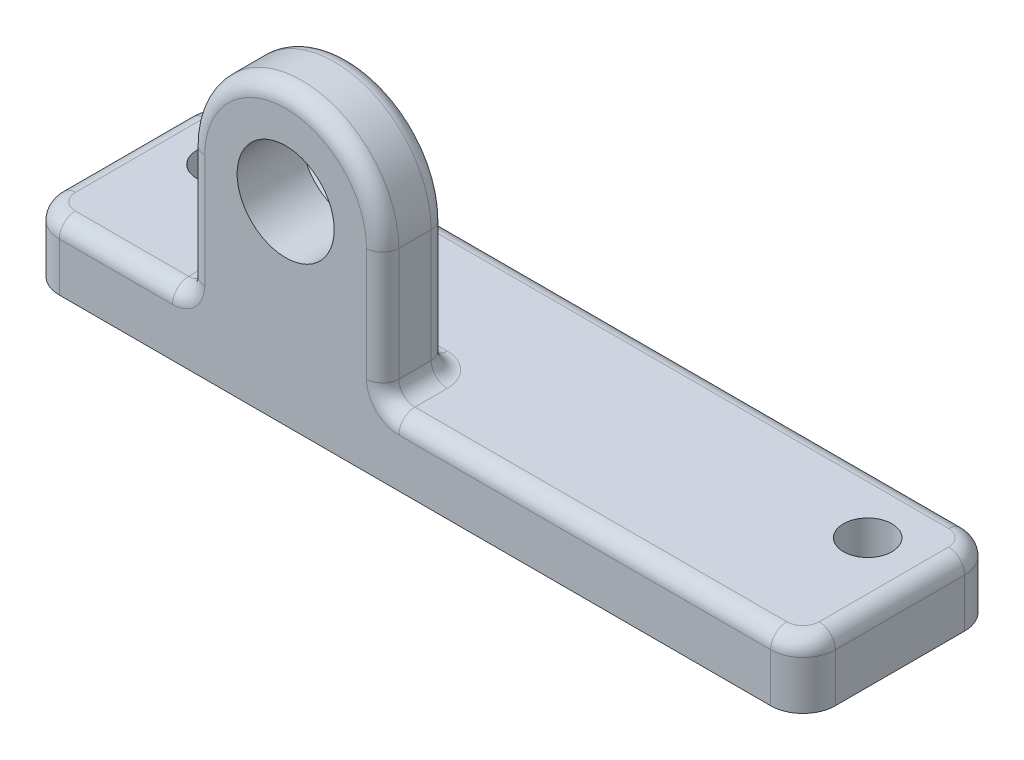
ISO-10303-21;
HEADER;
FILE_DESCRIPTION(('STEP AP214'),'2;1');
FILE_NAME('part.step','',(''),(''),'','','');
FILE_SCHEMA(('AUTOMOTIVE_DESIGN { 1 0 10303 214 1 1 1 1 }'));
ENDSEC;
DATA;
#1=APPLICATION_CONTEXT('core data for automotive mechanical design processes');
#2=APPLICATION_PROTOCOL_DEFINITION('international standard','automotive_design',2000,#1);
#3=PRODUCT_CONTEXT('',#1,'mechanical');
#4=PRODUCT('Part','Part','',(#3));
#5=PRODUCT_RELATED_PRODUCT_CATEGORY('part','',(#4));
#6=PRODUCT_DEFINITION_FORMATION('','',#4);
#7=PRODUCT_DEFINITION_CONTEXT('part definition',#1,'design');
#8=PRODUCT_DEFINITION('design','',#6,#7);
#9=PRODUCT_DEFINITION_SHAPE('','',#8);
#10=(LENGTH_UNIT() NAMED_UNIT(*) SI_UNIT(.MILLI.,.METRE.));
#11=(NAMED_UNIT(*) PLANE_ANGLE_UNIT() SI_UNIT($,.RADIAN.));
#12=(NAMED_UNIT(*) SI_UNIT($,.STERADIAN.) SOLID_ANGLE_UNIT());
#13=UNCERTAINTY_MEASURE_WITH_UNIT(LENGTH_MEASURE(1.E-05),#10,'distance_accuracy_value','');
#14=(GEOMETRIC_REPRESENTATION_CONTEXT(3) GLOBAL_UNCERTAINTY_ASSIGNED_CONTEXT((#13)) GLOBAL_UNIT_ASSIGNED_CONTEXT((#10,
#11,#12)) REPRESENTATION_CONTEXT('',''));
#15=CARTESIAN_POINT('',(0.,0.,0.));
#16=DIRECTION('',(0.,0.,1.));
#17=DIRECTION('',(1.,0.,0.));
#18=AXIS2_PLACEMENT_3D('',#15,#16,#17);
#19=CARTESIAN_POINT('',(0.,12.7,0.));
#20=DIRECTION('',(1.,0.,0.));
#21=DIRECTION('',(0.,0.,-1.));
#22=AXIS2_PLACEMENT_3D('',#19,#20,#21);
#23=PLANE('',#22);
#24=DIRECTION('',(0.,-1.,0.));
#25=VECTOR('',#24,1.);
#26=CARTESIAN_POINT('',(0.,12.7,-6.35));
#27=LINE('',#26,#25);
#28=CARTESIAN_POINT('',(0.,0.,-6.35));
#29=VERTEX_POINT('',#28);
#30=CARTESIAN_POINT('',(0.,9.525,-6.35));
#31=VERTEX_POINT('',#30);
#32=EDGE_CURVE('E204',#29,#31,#27,.F.);
#33=ORIENTED_EDGE('',*,*,#32,.T.);
#34=DIRECTION('',(0.,0.,1.));
#35=VECTOR('',#34,1.);
#36=CARTESIAN_POINT('',(0.,9.525,0.));
#37=LINE('',#36,#35);
#38=CARTESIAN_POINT('',(0.,9.525,-31.75));
#39=VERTEX_POINT('',#38);
#40=EDGE_CURVE('E282',#31,#39,#37,.F.);
#41=ORIENTED_EDGE('',*,*,#40,.T.);
#42=DIRECTION('',(0.,-1.,0.));
#43=VECTOR('',#42,1.);
#44=CARTESIAN_POINT('',(0.,12.7,-31.75));
#45=LINE('',#44,#43);
#46=CARTESIAN_POINT('',(0.,0.,-31.75));
#47=VERTEX_POINT('',#46);
#48=EDGE_CURVE('E208',#39,#47,#45,.T.);
#49=ORIENTED_EDGE('',*,*,#48,.T.);
#50=DIRECTION('',(0.,0.,1.));
#51=VECTOR('',#50,1.);
#52=CARTESIAN_POINT('',(0.,0.,0.));
#53=LINE('',#52,#51);
#54=EDGE_CURVE('E216',#47,#29,#53,.T.);
#55=ORIENTED_EDGE('',*,*,#54,.T.);
#56=EDGE_LOOP('',(#33,#41,#49,#55));
#57=FACE_BOUND('',#56,.T.);
#58=ADVANCED_FACE('F28',(#57),#23,.F.);
#59=CARTESIAN_POINT('',(0.,12.7,0.));
#60=DIRECTION('',(0.,0.,-1.));
#61=DIRECTION('',(-1.,0.,0.));
#62=AXIS2_PLACEMENT_3D('',#59,#60,#61);
#63=PLANE('',#62);
#64=CARTESIAN_POINT('',(50.8,38.1,0.));
#65=DIRECTION('',(0.,0.,1.));
#66=DIRECTION('',(1.,0.,0.));
#67=AXIS2_PLACEMENT_3D('',#64,#65,#66);
#68=CIRCLE('',#67,9.52499999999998);
#69=CARTESIAN_POINT('',(60.325,38.1,0.));
#70=VERTEX_POINT('',#69);
#71=EDGE_CURVE('E231',#70,#70,#68,.T.);
#72=ORIENTED_EDGE('',*,*,#71,.F.);
#73=EDGE_LOOP('',(#72));
#74=FACE_BOUND('',#73,.T.);
#75=CARTESIAN_POINT('',(28.575,15.875,0.));
#76=DIRECTION('',(0.,0.,-1.));
#77=DIRECTION('',(-1.,0.,0.));
#78=AXIS2_PLACEMENT_3D('',#75,#76,#77);
#79=CIRCLE('',#78,6.35);
#80=CARTESIAN_POINT('',(28.575,9.525,0.));
#81=VERTEX_POINT('',#80);
#82=CARTESIAN_POINT('',(34.925,15.875,0.));
#83=VERTEX_POINT('',#82);
#84=EDGE_CURVE('E301',#81,#83,#79,.F.);
#85=ORIENTED_EDGE('',*,*,#84,.F.);
#86=DIRECTION('',(1.,0.,0.));
#87=VECTOR('',#86,1.);
#88=CARTESIAN_POINT('',(0.,9.525,0.));
#89=LINE('',#88,#87);
#90=CARTESIAN_POINT('',(6.35,9.525,0.));
#91=VERTEX_POINT('',#90);
#92=EDGE_CURVE('E194',#81,#91,#89,.F.);
#93=ORIENTED_EDGE('',*,*,#92,.T.);
#94=DIRECTION('',(0.,-1.,0.));
#95=VECTOR('',#94,1.);
#96=CARTESIAN_POINT('',(6.35,12.7,0.));
#97=LINE('',#96,#95);
#98=CARTESIAN_POINT('',(6.35,0.,0.));
#99=VERTEX_POINT('',#98);
#100=EDGE_CURVE('E186',#91,#99,#97,.T.);
#101=ORIENTED_EDGE('',*,*,#100,.T.);
#102=DIRECTION('',(1.,0.,0.));
#103=VECTOR('',#102,1.);
#104=CARTESIAN_POINT('',(0.,0.,0.));
#105=LINE('',#104,#103);
#106=CARTESIAN_POINT('',(146.05,0.,0.));
#107=VERTEX_POINT('',#106);
#108=EDGE_CURVE('E191',#99,#107,#105,.T.);
#109=ORIENTED_EDGE('',*,*,#108,.T.);
#110=DIRECTION('',(0.,-1.,0.));
#111=VECTOR('',#110,1.);
#112=CARTESIAN_POINT('',(146.05,12.7,0.));
#113=LINE('',#112,#111);
#114=CARTESIAN_POINT('',(146.05,9.525,0.));
#115=VERTEX_POINT('',#114);
#116=EDGE_CURVE('E198',#107,#115,#113,.F.);
#117=ORIENTED_EDGE('',*,*,#116,.T.);
#118=DIRECTION('',(1.,0.,0.));
#119=VECTOR('',#118,1.);
#120=CARTESIAN_POINT('',(0.,9.525,0.));
#121=LINE('',#120,#119);
#122=CARTESIAN_POINT('',(73.025,9.525,0.));
#123=VERTEX_POINT('',#122);
#124=EDGE_CURVE('E299',#115,#123,#121,.F.);
#125=ORIENTED_EDGE('',*,*,#124,.T.);
#126=CARTESIAN_POINT('',(73.025,15.875,0.));
#127=DIRECTION('',(0.,0.,-1.));
#128=DIRECTION('',(-1.,0.,0.));
#129=AXIS2_PLACEMENT_3D('',#126,#127,#128);
#130=CIRCLE('',#129,6.35);
#131=CARTESIAN_POINT('',(66.675,15.875,0.));
#132=VERTEX_POINT('',#131);
#133=EDGE_CURVE('E296',#132,#123,#130,.F.);
#134=ORIENTED_EDGE('',*,*,#133,.F.);
#135=DIRECTION('',(0.,1.,0.));
#136=VECTOR('',#135,1.);
#137=CARTESIAN_POINT('',(66.675,38.1,0.));
#138=LINE('',#137,#136);
#139=CARTESIAN_POINT('',(66.675,38.1,0.));
#140=VERTEX_POINT('',#139);
#141=EDGE_CURVE('E294',#132,#140,#138,.T.);
#142=ORIENTED_EDGE('',*,*,#141,.T.);
#143=CARTESIAN_POINT('',(50.8,38.1,0.));
#144=DIRECTION('',(0.,0.,-1.));
#145=DIRECTION('',(-1.,0.,0.));
#146=AXIS2_PLACEMENT_3D('',#143,#144,#145);
#147=CIRCLE('',#146,15.875);
#148=CARTESIAN_POINT('',(34.925,38.1,0.));
#149=VERTEX_POINT('',#148);
#150=EDGE_CURVE('E290',#140,#149,#147,.F.);
#151=ORIENTED_EDGE('',*,*,#150,.T.);
#152=DIRECTION('',(0.,-1.,0.));
#153=VECTOR('',#152,1.);
#154=CARTESIAN_POINT('',(34.925,12.7,0.));
#155=LINE('',#154,#153);
#156=EDGE_CURVE('E292',#149,#83,#155,.T.);
#157=ORIENTED_EDGE('',*,*,#156,.T.);
#158=EDGE_LOOP('',(#85,#93,#101,#109,#117,#125,#134,#142,#151,#157));
#159=FACE_BOUND('',#158,.T.);
#160=ADVANCED_FACE('F188',(#74,#159),#63,.F.);
#161=CARTESIAN_POINT('',(152.4,12.7,0.));
#162=DIRECTION('',(-1.,0.,0.));
#163=DIRECTION('',(0.,0.,1.));
#164=AXIS2_PLACEMENT_3D('',#161,#162,#163);
#165=PLANE('',#164);
#166=DIRECTION('',(0.,-1.,0.));
#167=VECTOR('',#166,1.);
#168=CARTESIAN_POINT('',(152.4,12.7,-31.75));
#169=LINE('',#168,#167);
#170=CARTESIAN_POINT('',(152.4,0.,-31.75));
#171=VERTEX_POINT('',#170);
#172=CARTESIAN_POINT('',(152.4,9.525,-31.75));
#173=VERTEX_POINT('',#172);
#174=EDGE_CURVE('E243',#171,#173,#169,.F.);
#175=ORIENTED_EDGE('',*,*,#174,.T.);
#176=DIRECTION('',(0.,0.,-1.));
#177=VECTOR('',#176,1.);
#178=CARTESIAN_POINT('',(152.4,9.525,0.));
#179=LINE('',#178,#177);
#180=CARTESIAN_POINT('',(152.4,9.525,-6.35));
#181=VERTEX_POINT('',#180);
#182=EDGE_CURVE('E305',#173,#181,#179,.F.);
#183=ORIENTED_EDGE('',*,*,#182,.T.);
#184=DIRECTION('',(0.,-1.,0.));
#185=VECTOR('',#184,1.);
#186=CARTESIAN_POINT('',(152.4,12.7,-6.35));
#187=LINE('',#186,#185);
#188=CARTESIAN_POINT('',(152.4,0.,-6.35));
#189=VERTEX_POINT('',#188);
#190=EDGE_CURVE('E246',#181,#189,#187,.T.);
#191=ORIENTED_EDGE('',*,*,#190,.T.);
#192=DIRECTION('',(0.,0.,-1.));
#193=VECTOR('',#192,1.);
#194=CARTESIAN_POINT('',(152.4,0.,0.));
#195=LINE('',#194,#193);
#196=EDGE_CURVE('E215',#189,#171,#195,.T.);
#197=ORIENTED_EDGE('',*,*,#196,.T.);
#198=EDGE_LOOP('',(#175,#183,#191,#197));
#199=FACE_BOUND('',#198,.T.);
#200=ADVANCED_FACE('F400',(#199),#165,.F.);
#201=CARTESIAN_POINT('',(0.,12.7,-38.1));
#202=DIRECTION('',(0.,0.,1.));
#203=DIRECTION('',(1.,0.,0.));
#204=AXIS2_PLACEMENT_3D('',#201,#202,#203);
#205=PLANE('',#204);
#206=DIRECTION('',(0.,-1.,0.));
#207=VECTOR('',#206,1.);
#208=CARTESIAN_POINT('',(6.35,12.7,-38.1));
#209=LINE('',#208,#207);
#210=CARTESIAN_POINT('',(6.35,0.,-38.1));
#211=VERTEX_POINT('',#210);
#212=CARTESIAN_POINT('',(6.35,9.525,-38.1));
#213=VERTEX_POINT('',#212);
#214=EDGE_CURVE('E240',#211,#213,#209,.F.);
#215=ORIENTED_EDGE('',*,*,#214,.T.);
#216=DIRECTION('',(-1.,0.,0.));
#217=VECTOR('',#216,1.);
#218=CARTESIAN_POINT('',(0.,9.525,-38.1));
#219=LINE('',#218,#217);
#220=CARTESIAN_POINT('',(146.05,9.525,-38.1));
#221=VERTEX_POINT('',#220);
#222=EDGE_CURVE('E284',#213,#221,#219,.F.);
#223=ORIENTED_EDGE('',*,*,#222,.T.);
#224=DIRECTION('',(0.,-1.,0.));
#225=VECTOR('',#224,1.);
#226=CARTESIAN_POINT('',(146.05,12.7,-38.1));
#227=LINE('',#226,#225);
#228=CARTESIAN_POINT('',(146.05,0.,-38.1));
#229=VERTEX_POINT('',#228);
#230=EDGE_CURVE('E238',#221,#229,#227,.T.);
#231=ORIENTED_EDGE('',*,*,#230,.T.);
#232=DIRECTION('',(-1.,0.,0.));
#233=VECTOR('',#232,1.);
#234=CARTESIAN_POINT('',(0.,0.,-38.1));
#235=LINE('',#234,#233);
#236=EDGE_CURVE('E219',#229,#211,#235,.T.);
#237=ORIENTED_EDGE('',*,*,#236,.T.);
#238=EDGE_LOOP('',(#215,#223,#231,#237));
#239=FACE_BOUND('',#238,.T.);
#240=ADVANCED_FACE('F405',(#239),#205,.F.);
#241=CARTESIAN_POINT('',(0.,12.7,-38.1));
#242=DIRECTION('',(0.,-1.,0.));
#243=DIRECTION('',(0.,0.,-1.));
#244=AXIS2_PLACEMENT_3D('',#241,#242,#243);
#245=PLANE('',#244);
#246=DIRECTION('',(-1.,0.,0.));
#247=VECTOR('',#246,1.);
#248=CARTESIAN_POINT('',(0.,12.7,-34.925));
#249=LINE('',#248,#247);
#250=CARTESIAN_POINT('',(146.05,12.7,-34.925));
#251=VERTEX_POINT('',#250);
#252=CARTESIAN_POINT('',(6.35,12.7,-34.925));
#253=VERTEX_POINT('',#252);
#254=EDGE_CURVE('E272',#251,#253,#249,.T.);
#255=ORIENTED_EDGE('',*,*,#254,.T.);
#256=CARTESIAN_POINT('',(6.35,12.7,-31.75));
#257=DIRECTION('',(0.,-1.,0.));
#258=DIRECTION('',(0.,0.,-1.));
#259=AXIS2_PLACEMENT_3D('',#256,#257,#258);
#260=CIRCLE('',#259,3.175);
#261=CARTESIAN_POINT('',(3.175,12.7,-31.75));
#262=VERTEX_POINT('',#261);
#263=EDGE_CURVE('E276',#253,#262,#260,.F.);
#264=ORIENTED_EDGE('',*,*,#263,.T.);
#265=DIRECTION('',(0.,0.,1.));
#266=VECTOR('',#265,1.);
#267=CARTESIAN_POINT('',(3.175,12.7,-38.1));
#268=LINE('',#267,#266);
#269=CARTESIAN_POINT('',(3.175,12.7,-6.35));
#270=VERTEX_POINT('',#269);
#271=EDGE_CURVE('E274',#262,#270,#268,.T.);
#272=ORIENTED_EDGE('',*,*,#271,.T.);
#273=CARTESIAN_POINT('',(6.35,12.7,-6.35));
#274=DIRECTION('',(0.,-1.,0.));
#275=DIRECTION('',(0.,0.,-1.));
#276=AXIS2_PLACEMENT_3D('',#273,#274,#275);
#277=CIRCLE('',#276,3.175);
#278=CARTESIAN_POINT('',(6.35,12.7,-3.175));
#279=VERTEX_POINT('',#278);
#280=EDGE_CURVE('E270',#270,#279,#277,.F.);
#281=ORIENTED_EDGE('',*,*,#280,.T.);
#282=DIRECTION('',(1.,0.,0.));
#283=VECTOR('',#282,1.);
#284=CARTESIAN_POINT('',(0.,12.7,-3.175));
#285=LINE('',#284,#283);
#286=CARTESIAN_POINT('',(28.575,12.7,-3.175));
#287=VERTEX_POINT('',#286);
#288=EDGE_CURVE('E266',#279,#287,#285,.T.);
#289=ORIENTED_EDGE('',*,*,#288,.T.);
#290=DIRECTION('',(0.,0.,-1.));
#291=VECTOR('',#290,1.);
#292=CARTESIAN_POINT('',(28.575,12.7,-38.1));
#293=LINE('',#292,#291);
#294=CARTESIAN_POINT('',(28.575,12.7,-9.525));
#295=VERTEX_POINT('',#294);
#296=EDGE_CURVE('E262',#287,#295,#293,.T.);
#297=ORIENTED_EDGE('',*,*,#296,.T.);
#298=CARTESIAN_POINT('',(34.925,12.7,-9.525));
#299=DIRECTION('',(0.,-1.,0.));
#300=DIRECTION('',(0.,0.,-1.));
#301=AXIS2_PLACEMENT_3D('',#298,#299,#300);
#302=CIRCLE('',#301,6.35);
#303=CARTESIAN_POINT('',(34.925,12.7,-15.875));
#304=VERTEX_POINT('',#303);
#305=EDGE_CURVE('E259',#304,#295,#302,.F.);
#306=ORIENTED_EDGE('',*,*,#305,.F.);
#307=DIRECTION('',(1.,0.,0.));
#308=VECTOR('',#307,1.);
#309=CARTESIAN_POINT('',(0.,12.7,-15.875));
#310=LINE('',#309,#308);
#311=CARTESIAN_POINT('',(66.675,12.7,-15.875));
#312=VERTEX_POINT('',#311);
#313=EDGE_CURVE('E255',#304,#312,#310,.T.);
#314=ORIENTED_EDGE('',*,*,#313,.T.);
#315=CARTESIAN_POINT('',(66.675,12.7,-9.525));
#316=DIRECTION('',(0.,-1.,0.));
#317=DIRECTION('',(0.,0.,-1.));
#318=AXIS2_PLACEMENT_3D('',#315,#316,#317);
#319=CIRCLE('',#318,6.35);
#320=CARTESIAN_POINT('',(73.025,12.7,-9.525));
#321=VERTEX_POINT('',#320);
#322=EDGE_CURVE('E252',#321,#312,#319,.F.);
#323=ORIENTED_EDGE('',*,*,#322,.F.);
#324=DIRECTION('',(0.,0.,1.));
#325=VECTOR('',#324,1.);
#326=CARTESIAN_POINT('',(73.025,12.7,-38.1));
#327=LINE('',#326,#325);
#328=CARTESIAN_POINT('',(73.025,12.7,-3.175));
#329=VERTEX_POINT('',#328);
#330=EDGE_CURVE('E248',#321,#329,#327,.T.);
#331=ORIENTED_EDGE('',*,*,#330,.T.);
#332=DIRECTION('',(1.,0.,0.));
#333=VECTOR('',#332,1.);
#334=CARTESIAN_POINT('',(0.,12.7,-3.175));
#335=LINE('',#334,#333);
#336=CARTESIAN_POINT('',(146.05,12.7,-3.175));
#337=VERTEX_POINT('',#336);
#338=EDGE_CURVE('E250',#329,#337,#335,.T.);
#339=ORIENTED_EDGE('',*,*,#338,.T.);
#340=CARTESIAN_POINT('',(146.05,12.7,-6.35));
#341=DIRECTION('',(0.,-1.,0.));
#342=DIRECTION('',(0.,0.,-1.));
#343=AXIS2_PLACEMENT_3D('',#340,#341,#342);
#344=CIRCLE('',#343,3.175);
#345=CARTESIAN_POINT('',(149.225,12.7,-6.35));
#346=VERTEX_POINT('',#345);
#347=EDGE_CURVE('E257',#337,#346,#344,.F.);
#348=ORIENTED_EDGE('',*,*,#347,.T.);
#349=DIRECTION('',(0.,0.,-1.));
#350=VECTOR('',#349,1.);
#351=CARTESIAN_POINT('',(149.225,12.7,-38.1));
#352=LINE('',#351,#350);
#353=CARTESIAN_POINT('',(149.225,12.7,-31.75));
#354=VERTEX_POINT('',#353);
#355=EDGE_CURVE('E264',#346,#354,#352,.T.);
#356=ORIENTED_EDGE('',*,*,#355,.T.);
#357=CARTESIAN_POINT('',(146.05,12.7,-31.75));
#358=DIRECTION('',(0.,-1.,0.));
#359=DIRECTION('',(0.,0.,-1.));
#360=AXIS2_PLACEMENT_3D('',#357,#358,#359);
#361=CIRCLE('',#360,3.175);
#362=EDGE_CURVE('E268',#354,#251,#361,.F.);
#363=ORIENTED_EDGE('',*,*,#362,.T.);
#364=EDGE_LOOP('',(#255,#264,#272,#281,#289,#297,#306,#314,#323,#331,#339,#348,#356,#363));
#365=FACE_BOUND('',#364,.T.);
#366=CARTESIAN_POINT('',(139.7,12.7,-25.4));
#367=DIRECTION('',(0.,1.,0.));
#368=DIRECTION('',(0.,0.,1.));
#369=AXIS2_PLACEMENT_3D('',#366,#367,#368);
#370=CIRCLE('',#369,4.76249999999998);
#371=CARTESIAN_POINT('',(139.7,12.7,-20.6375));
#372=VERTEX_POINT('',#371);
#373=EDGE_CURVE('E381',#372,#372,#370,.T.);
#374=ORIENTED_EDGE('',*,*,#373,.F.);
#375=EDGE_LOOP('',(#374));
#376=FACE_BOUND('',#375,.T.);
#377=CARTESIAN_POINT('',(12.7,12.7,-25.4));
#378=DIRECTION('',(0.,1.,0.));
#379=DIRECTION('',(0.,0.,1.));
#380=AXIS2_PLACEMENT_3D('',#377,#378,#379);
#381=CIRCLE('',#380,4.76249999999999);
#382=CARTESIAN_POINT('',(12.7,12.7,-20.6375));
#383=VERTEX_POINT('',#382);
#384=EDGE_CURVE('E387',#383,#383,#381,.T.);
#385=ORIENTED_EDGE('',*,*,#384,.F.);
#386=EDGE_LOOP('',(#385));
#387=FACE_BOUND('',#386,.T.);
#388=ADVANCED_FACE('F412',(#365,#376,#387),#245,.F.);
#389=CARTESIAN_POINT('',(0.,0.,-38.1));
#390=DIRECTION('',(0.,-1.,0.));
#391=DIRECTION('',(0.,0.,-1.));
#392=AXIS2_PLACEMENT_3D('',#389,#390,#391);
#393=PLANE('',#392);
#394=CARTESIAN_POINT('',(139.7,0.,-25.4));
#395=DIRECTION('',(0.,1.,0.));
#396=DIRECTION('',(0.,0.,1.));
#397=AXIS2_PLACEMENT_3D('',#394,#395,#396);
#398=CIRCLE('',#397,4.7625);
#399=CARTESIAN_POINT('',(139.7,0.,-20.6375));
#400=VERTEX_POINT('',#399);
#401=EDGE_CURVE('E384',#400,#400,#398,.T.);
#402=ORIENTED_EDGE('',*,*,#401,.T.);
#403=EDGE_LOOP('',(#402));
#404=FACE_BOUND('',#403,.T.);
#405=CARTESIAN_POINT('',(12.7,0.,-25.4));
#406=DIRECTION('',(0.,1.,0.));
#407=DIRECTION('',(0.,0.,1.));
#408=AXIS2_PLACEMENT_3D('',#405,#406,#407);
#409=CIRCLE('',#408,4.7625);
#410=CARTESIAN_POINT('',(12.7,0.,-20.6375));
#411=VERTEX_POINT('',#410);
#412=EDGE_CURVE('E390',#411,#411,#409,.T.);
#413=ORIENTED_EDGE('',*,*,#412,.T.);
#414=EDGE_LOOP('',(#413));
#415=FACE_BOUND('',#414,.T.);
#416=ORIENTED_EDGE('',*,*,#108,.F.);
#417=CARTESIAN_POINT('',(6.35,0.,-6.35));
#418=DIRECTION('',(0.,-1.,0.));
#419=DIRECTION('',(0.,0.,-1.));
#420=AXIS2_PLACEMENT_3D('',#417,#418,#419);
#421=CIRCLE('',#420,6.35);
#422=EDGE_CURVE('E201',#99,#29,#421,.T.);
#423=ORIENTED_EDGE('',*,*,#422,.T.);
#424=ORIENTED_EDGE('',*,*,#54,.F.);
#425=CARTESIAN_POINT('',(6.35,0.,-31.75));
#426=DIRECTION('',(0.,-1.,0.));
#427=DIRECTION('',(0.,0.,-1.));
#428=AXIS2_PLACEMENT_3D('',#425,#426,#427);
#429=CIRCLE('',#428,6.35);
#430=EDGE_CURVE('E209',#47,#211,#429,.T.);
#431=ORIENTED_EDGE('',*,*,#430,.T.);
#432=ORIENTED_EDGE('',*,*,#236,.F.);
#433=CARTESIAN_POINT('',(146.05,0.,-31.75));
#434=DIRECTION('',(0.,-1.,0.));
#435=DIRECTION('',(0.,0.,-1.));
#436=AXIS2_PLACEMENT_3D('',#433,#434,#435);
#437=CIRCLE('',#436,6.35);
#438=EDGE_CURVE('E197',#229,#171,#437,.T.);
#439=ORIENTED_EDGE('',*,*,#438,.T.);
#440=ORIENTED_EDGE('',*,*,#196,.F.);
#441=CARTESIAN_POINT('',(146.05,0.,-6.35));
#442=DIRECTION('',(0.,-1.,0.));
#443=DIRECTION('',(0.,0.,-1.));
#444=AXIS2_PLACEMENT_3D('',#441,#442,#443);
#445=CIRCLE('',#444,6.35);
#446=EDGE_CURVE('E214',#189,#107,#445,.T.);
#447=ORIENTED_EDGE('',*,*,#446,.T.);
#448=EDGE_LOOP('',(#416,#423,#424,#431,#432,#439,#440,#447));
#449=FACE_BOUND('',#448,.T.);
#450=ADVANCED_FACE('F211',(#404,#415,#449),#393,.T.);
#451=CARTESIAN_POINT('',(31.75,0.,-12.7));
#452=DIRECTION('',(-1.,0.,0.));
#453=DIRECTION('',(0.,0.,1.));
#454=AXIS2_PLACEMENT_3D('',#451,#452,#453);
#455=PLANE('',#454);
#456=DIRECTION('',(0.,0.,1.));
#457=VECTOR('',#456,1.);
#458=CARTESIAN_POINT('',(31.75,38.1,-12.7));
#459=LINE('',#458,#457);
#460=CARTESIAN_POINT('',(31.75,38.1,-9.525));
#461=VERTEX_POINT('',#460);
#462=CARTESIAN_POINT('',(31.75,38.1,-3.175));
#463=VERTEX_POINT('',#462);
#464=EDGE_CURVE('E221',#461,#463,#459,.T.);
#465=ORIENTED_EDGE('',*,*,#464,.F.);
#466=DIRECTION('',(0.,-1.,0.));
#467=VECTOR('',#466,1.);
#468=CARTESIAN_POINT('',(31.75,0.,-9.525));
#469=LINE('',#468,#467);
#470=CARTESIAN_POINT('',(31.75,15.875,-9.525));
#471=VERTEX_POINT('',#470);
#472=EDGE_CURVE('E312',#461,#471,#469,.T.);
#473=ORIENTED_EDGE('',*,*,#472,.T.);
#474=DIRECTION('',(0.,0.,-1.));
#475=VECTOR('',#474,1.);
#476=CARTESIAN_POINT('',(31.75,15.875,-12.7));
#477=LINE('',#476,#475);
#478=CARTESIAN_POINT('',(31.75,15.875,-3.175));
#479=VERTEX_POINT('',#478);
#480=EDGE_CURVE('E309',#471,#479,#477,.F.);
#481=ORIENTED_EDGE('',*,*,#480,.T.);
#482=DIRECTION('',(0.,-1.,0.));
#483=VECTOR('',#482,1.);
#484=CARTESIAN_POINT('',(31.75,38.1,-3.175));
#485=LINE('',#484,#483);
#486=EDGE_CURVE('E307',#479,#463,#485,.F.);
#487=ORIENTED_EDGE('',*,*,#486,.T.);
#488=EDGE_LOOP('',(#465,#473,#481,#487));
#489=FACE_BOUND('',#488,.T.);
#490=ADVANCED_FACE('F419',(#489),#455,.T.);
#491=CARTESIAN_POINT('',(69.85,38.1,-12.7));
#492=DIRECTION('',(1.,0.,0.));
#493=DIRECTION('',(0.,0.,-1.));
#494=AXIS2_PLACEMENT_3D('',#491,#492,#493);
#495=PLANE('',#494);
#496=DIRECTION('',(0.,0.,1.));
#497=VECTOR('',#496,1.);
#498=CARTESIAN_POINT('',(69.85,15.875,-12.7));
#499=LINE('',#498,#497);
#500=CARTESIAN_POINT('',(69.85,15.875,-3.175));
#501=VERTEX_POINT('',#500);
#502=CARTESIAN_POINT('',(69.85,15.875,-9.525));
#503=VERTEX_POINT('',#502);
#504=EDGE_CURVE('E42',#501,#503,#499,.F.);
#505=ORIENTED_EDGE('',*,*,#504,.T.);
#506=DIRECTION('',(0.,1.,0.));
#507=VECTOR('',#506,1.);
#508=CARTESIAN_POINT('',(69.85,38.1,-9.525));
#509=LINE('',#508,#507);
#510=CARTESIAN_POINT('',(69.85,38.1,-9.525));
#511=VERTEX_POINT('',#510);
#512=EDGE_CURVE('E327',#503,#511,#509,.T.);
#513=ORIENTED_EDGE('',*,*,#512,.T.);
#514=DIRECTION('',(0.,0.,1.));
#515=VECTOR('',#514,1.);
#516=CARTESIAN_POINT('',(69.85,38.1,-12.7));
#517=LINE('',#516,#515);
#518=CARTESIAN_POINT('',(69.85,38.1,-3.175));
#519=VERTEX_POINT('',#518);
#520=EDGE_CURVE('E230',#511,#519,#517,.T.);
#521=ORIENTED_EDGE('',*,*,#520,.T.);
#522=DIRECTION('',(0.,1.,0.));
#523=VECTOR('',#522,1.);
#524=CARTESIAN_POINT('',(69.85,12.7,-3.175));
#525=LINE('',#524,#523);
#526=EDGE_CURVE('E47',#519,#501,#525,.F.);
#527=ORIENTED_EDGE('',*,*,#526,.T.);
#528=EDGE_LOOP('',(#505,#513,#521,#527));
#529=FACE_BOUND('',#528,.T.);
#530=ADVANCED_FACE('F339',(#529),#495,.T.);
#531=CARTESIAN_POINT('',(50.8,38.1,-12.7));
#532=DIRECTION('',(0.,0.,-1.));
#533=DIRECTION('',(-1.,0.,0.));
#534=AXIS2_PLACEMENT_3D('',#531,#532,#533);
#535=PLANE('',#534);
#536=DIRECTION('',(0.,1.,0.));
#537=VECTOR('',#536,1.);
#538=CARTESIAN_POINT('',(66.675,38.1,-12.7));
#539=LINE('',#538,#537);
#540=CARTESIAN_POINT('',(66.675,38.1,-12.7));
#541=VERTEX_POINT('',#540);
#542=CARTESIAN_POINT('',(66.675,15.875,-12.7));
#543=VERTEX_POINT('',#542);
#544=EDGE_CURVE('E320',#541,#543,#539,.F.);
#545=ORIENTED_EDGE('',*,*,#544,.T.);
#546=DIRECTION('',(1.,0.,0.));
#547=VECTOR('',#546,1.);
#548=CARTESIAN_POINT('',(50.8,15.875,-12.7));
#549=LINE('',#548,#547);
#550=CARTESIAN_POINT('',(34.925,15.875,-12.7));
#551=VERTEX_POINT('',#550);
#552=EDGE_CURVE('E322',#543,#551,#549,.F.);
#553=ORIENTED_EDGE('',*,*,#552,.T.);
#554=DIRECTION('',(0.,-1.,0.));
#555=VECTOR('',#554,1.);
#556=CARTESIAN_POINT('',(34.925,38.1,-12.7));
#557=LINE('',#556,#555);
#558=CARTESIAN_POINT('',(34.925,38.1,-12.7));
#559=VERTEX_POINT('',#558);
#560=EDGE_CURVE('E318',#551,#559,#557,.F.);
#561=ORIENTED_EDGE('',*,*,#560,.T.);
#562=CARTESIAN_POINT('',(50.8,38.1,-12.7));
#563=DIRECTION('',(0.,0.,-1.));
#564=DIRECTION('',(-1.,0.,0.));
#565=AXIS2_PLACEMENT_3D('',#562,#563,#564);
#566=CIRCLE('',#565,15.875);
#567=EDGE_CURVE('E316',#559,#541,#566,.T.);
#568=ORIENTED_EDGE('',*,*,#567,.T.);
#569=EDGE_LOOP('',(#545,#553,#561,#568));
#570=FACE_BOUND('',#569,.T.);
#571=CARTESIAN_POINT('',(50.8,38.1,-12.7));
#572=DIRECTION('',(0.,0.,-1.));
#573=DIRECTION('',(-1.,0.,0.));
#574=AXIS2_PLACEMENT_3D('',#571,#572,#573);
#575=CIRCLE('',#574,9.52499999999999);
#576=CARTESIAN_POINT('',(41.275,38.1,-12.7));
#577=VERTEX_POINT('',#576);
#578=EDGE_CURVE('E227',#577,#577,#575,.T.);
#579=ORIENTED_EDGE('',*,*,#578,.F.);
#580=EDGE_LOOP('',(#579));
#581=FACE_BOUND('',#580,.T.);
#582=ADVANCED_FACE('F423',(#570,#581),#535,.T.);
#583=CARTESIAN_POINT('',(50.8,38.1,-12.7));
#584=DIRECTION('',(0.,0.,1.));
#585=DIRECTION('',(1.,0.,0.));
#586=AXIS2_PLACEMENT_3D('',#583,#584,#585);
#587=CYLINDRICAL_SURFACE('',#586,19.05);
#588=ORIENTED_EDGE('',*,*,#520,.F.);
#589=CARTESIAN_POINT('',(50.8,38.1,-9.525));
#590=DIRECTION('',(0.,0.,-1.));
#591=DIRECTION('',(-1.,0.,0.));
#592=AXIS2_PLACEMENT_3D('',#589,#590,#591);
#593=CIRCLE('',#592,19.05);
#594=EDGE_CURVE('E11',#511,#461,#593,.F.);
#595=ORIENTED_EDGE('',*,*,#594,.T.);
#596=ORIENTED_EDGE('',*,*,#464,.T.);
#597=CARTESIAN_POINT('',(50.8,38.1,-3.175));
#598=DIRECTION('',(0.,0.,-1.));
#599=DIRECTION('',(-1.,0.,0.));
#600=AXIS2_PLACEMENT_3D('',#597,#598,#599);
#601=CIRCLE('',#600,19.05);
#602=EDGE_CURVE('E35',#463,#519,#601,.T.);
#603=ORIENTED_EDGE('',*,*,#602,.T.);
#604=EDGE_LOOP('',(#588,#595,#596,#603));
#605=FACE_BOUND('',#604,.T.);
#606=ADVANCED_FACE('F332',(#605),#587,.T.);
#607=CARTESIAN_POINT('',(50.8,38.1,0.));
#608=DIRECTION('',(0.,0.,1.));
#609=DIRECTION('',(1.,0.,0.));
#610=AXIS2_PLACEMENT_3D('',#607,#608,#609);
#611=CYLINDRICAL_SURFACE('',#610,9.52499999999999);
#612=ORIENTED_EDGE('',*,*,#578,.T.);
#613=EDGE_LOOP('',(#612));
#614=FACE_BOUND('',#613,.T.);
#615=ORIENTED_EDGE('',*,*,#71,.T.);
#616=EDGE_LOOP('',(#615));
#617=FACE_BOUND('',#616,.T.);
#618=ADVANCED_FACE('F397',(#614,#617),#611,.F.);
#619=CARTESIAN_POINT('',(12.7,12.7,-25.4));
#620=DIRECTION('',(0.,1.,0.));
#621=DIRECTION('',(0.,0.,1.));
#622=AXIS2_PLACEMENT_3D('',#619,#620,#621);
#623=CYLINDRICAL_SURFACE('',#622,4.76249999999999);
#624=ORIENTED_EDGE('',*,*,#412,.F.);
#625=EDGE_LOOP('',(#624));
#626=FACE_BOUND('',#625,.T.);
#627=ORIENTED_EDGE('',*,*,#384,.T.);
#628=EDGE_LOOP('',(#627));
#629=FACE_BOUND('',#628,.T.);
#630=ADVANCED_FACE('F434',(#626,#629),#623,.F.);
#631=CARTESIAN_POINT('',(139.7,12.7,-25.4));
#632=DIRECTION('',(0.,1.,0.));
#633=DIRECTION('',(0.,0.,1.));
#634=AXIS2_PLACEMENT_3D('',#631,#632,#633);
#635=CYLINDRICAL_SURFACE('',#634,4.76249999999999);
#636=ORIENTED_EDGE('',*,*,#401,.F.);
#637=EDGE_LOOP('',(#636));
#638=FACE_BOUND('',#637,.T.);
#639=ORIENTED_EDGE('',*,*,#373,.T.);
#640=EDGE_LOOP('',(#639));
#641=FACE_BOUND('',#640,.T.);
#642=ADVANCED_FACE('F438',(#638,#641),#635,.F.);
#643=CARTESIAN_POINT('',(6.35,12.7,-6.35));
#644=DIRECTION('',(0.,-1.,0.));
#645=DIRECTION('',(0.,0.,-1.));
#646=AXIS2_PLACEMENT_3D('',#643,#644,#645);
#647=CYLINDRICAL_SURFACE('',#646,6.35);
#648=ORIENTED_EDGE('',*,*,#100,.F.);
#649=CARTESIAN_POINT('',(6.35,9.525,-6.35));
#650=DIRECTION('',(0.,-1.,0.));
#651=DIRECTION('',(0.,0.,-1.));
#652=AXIS2_PLACEMENT_3D('',#649,#650,#651);
#653=CIRCLE('',#652,6.35);
#654=EDGE_CURVE('E286',#91,#31,#653,.T.);
#655=ORIENTED_EDGE('',*,*,#654,.T.);
#656=ORIENTED_EDGE('',*,*,#32,.F.);
#657=ORIENTED_EDGE('',*,*,#422,.F.);
#658=EDGE_LOOP('',(#648,#655,#656,#657));
#659=FACE_BOUND('',#658,.T.);
#660=ADVANCED_FACE('F202',(#659),#647,.T.);
#661=CARTESIAN_POINT('',(6.35,12.7,-31.75));
#662=DIRECTION('',(0.,-1.,0.));
#663=DIRECTION('',(0.,0.,-1.));
#664=AXIS2_PLACEMENT_3D('',#661,#662,#663);
#665=CYLINDRICAL_SURFACE('',#664,6.35);
#666=ORIENTED_EDGE('',*,*,#48,.F.);
#667=CARTESIAN_POINT('',(6.35,9.525,-31.75));
#668=DIRECTION('',(0.,-1.,0.));
#669=DIRECTION('',(0.,0.,-1.));
#670=AXIS2_PLACEMENT_3D('',#667,#668,#669);
#671=CIRCLE('',#670,6.35);
#672=EDGE_CURVE('E279',#39,#213,#671,.T.);
#673=ORIENTED_EDGE('',*,*,#672,.T.);
#674=ORIENTED_EDGE('',*,*,#214,.F.);
#675=ORIENTED_EDGE('',*,*,#430,.F.);
#676=EDGE_LOOP('',(#666,#673,#674,#675));
#677=FACE_BOUND('',#676,.T.);
#678=ADVANCED_FACE('F445',(#677),#665,.T.);
#679=CARTESIAN_POINT('',(146.05,12.7,-6.35));
#680=DIRECTION('',(0.,-1.,0.));
#681=DIRECTION('',(0.,0.,-1.));
#682=AXIS2_PLACEMENT_3D('',#679,#680,#681);
#683=CYLINDRICAL_SURFACE('',#682,6.35);
#684=ORIENTED_EDGE('',*,*,#190,.F.);
#685=CARTESIAN_POINT('',(146.05,9.525,-6.35));
#686=DIRECTION('',(0.,-1.,0.));
#687=DIRECTION('',(0.,0.,-1.));
#688=AXIS2_PLACEMENT_3D('',#685,#686,#687);
#689=CIRCLE('',#688,6.35);
#690=EDGE_CURVE('E314',#181,#115,#689,.T.);
#691=ORIENTED_EDGE('',*,*,#690,.T.);
#692=ORIENTED_EDGE('',*,*,#116,.F.);
#693=ORIENTED_EDGE('',*,*,#446,.F.);
#694=EDGE_LOOP('',(#684,#691,#692,#693));
#695=FACE_BOUND('',#694,.T.);
#696=ADVANCED_FACE('F448',(#695),#683,.T.);
#697=CARTESIAN_POINT('',(146.05,12.7,-31.75));
#698=DIRECTION('',(0.,-1.,0.));
#699=DIRECTION('',(0.,0.,-1.));
#700=AXIS2_PLACEMENT_3D('',#697,#698,#699);
#701=CYLINDRICAL_SURFACE('',#700,6.35);
#702=ORIENTED_EDGE('',*,*,#230,.F.);
#703=CARTESIAN_POINT('',(146.05,9.525,-31.75));
#704=DIRECTION('',(0.,-1.,0.));
#705=DIRECTION('',(0.,0.,-1.));
#706=AXIS2_PLACEMENT_3D('',#703,#704,#705);
#707=CIRCLE('',#706,6.35);
#708=EDGE_CURVE('E288',#221,#173,#707,.T.);
#709=ORIENTED_EDGE('',*,*,#708,.T.);
#710=ORIENTED_EDGE('',*,*,#174,.F.);
#711=ORIENTED_EDGE('',*,*,#438,.F.);
#712=EDGE_LOOP('',(#702,#709,#710,#711));
#713=FACE_BOUND('',#712,.T.);
#714=ADVANCED_FACE('F452',(#713),#701,.T.);
#715=CARTESIAN_POINT('',(66.675,38.1,-9.525));
#716=DIRECTION('',(0.,1.,0.));
#717=DIRECTION('',(0.,0.,1.));
#718=AXIS2_PLACEMENT_3D('',#715,#716,#717);
#719=CYLINDRICAL_SURFACE('',#718,3.175);
#720=CARTESIAN_POINT('',(66.675,15.875,-9.525));
#721=DIRECTION('',(0.,-1.,0.));
#722=DIRECTION('',(0.,0.,-1.));
#723=AXIS2_PLACEMENT_3D('',#720,#721,#722);
#724=CIRCLE('',#723,3.175);
#725=EDGE_CURVE('E378',#543,#503,#724,.T.);
#726=ORIENTED_EDGE('',*,*,#725,.F.);
#727=ORIENTED_EDGE('',*,*,#544,.F.);
#728=CARTESIAN_POINT('',(66.675,38.1,-9.525));
#729=DIRECTION('',(0.,1.,0.));
#730=DIRECTION('',(0.,0.,1.));
#731=AXIS2_PLACEMENT_3D('',#728,#729,#730);
#732=CIRCLE('',#731,3.175);
#733=EDGE_CURVE('E375',#511,#541,#732,.T.);
#734=ORIENTED_EDGE('',*,*,#733,.F.);
#735=ORIENTED_EDGE('',*,*,#512,.F.);
#736=EDGE_LOOP('',(#726,#727,#734,#735));
#737=FACE_BOUND('',#736,.T.);
#738=ADVANCED_FACE('F456',(#737),#719,.T.);
#739=CARTESIAN_POINT('',(66.675,15.875,-9.525));
#740=DIRECTION('',(0.,-1.,0.));
#741=DIRECTION('',(0.,0.,-1.));
#742=AXIS2_PLACEMENT_3D('',#739,#740,#741);
#743=TOROIDAL_SURFACE('',#742,6.35,3.175);
#744=CARTESIAN_POINT('',(66.675,15.875,-15.875));
#745=DIRECTION('',(-1.,0.,0.));
#746=DIRECTION('',(0.,0.,1.));
#747=AXIS2_PLACEMENT_3D('',#744,#745,#746);
#748=CIRCLE('',#747,3.175);
#749=EDGE_CURVE('E369',#543,#312,#748,.F.);
#750=ORIENTED_EDGE('',*,*,#749,.F.);
#751=ORIENTED_EDGE('',*,*,#725,.T.);
#752=CARTESIAN_POINT('',(73.025,15.875,-9.525));
#753=DIRECTION('',(0.,0.,1.));
#754=DIRECTION('',(1.,0.,0.));
#755=AXIS2_PLACEMENT_3D('',#752,#753,#754);
#756=CIRCLE('',#755,3.175);
#757=EDGE_CURVE('E372',#321,#503,#756,.F.);
#758=ORIENTED_EDGE('',*,*,#757,.F.);
#759=ORIENTED_EDGE('',*,*,#322,.T.);
#760=EDGE_LOOP('',(#750,#751,#758,#759));
#761=FACE_BOUND('',#760,.T.);
#762=ADVANCED_FACE('F460',(#761),#743,.F.);
#763=CARTESIAN_POINT('',(50.8,38.1,-9.525));
#764=DIRECTION('',(0.,0.,-1.));
#765=DIRECTION('',(-1.,0.,0.));
#766=AXIS2_PLACEMENT_3D('',#763,#764,#765);
#767=TOROIDAL_SURFACE('',#766,15.875,3.175);
#768=ORIENTED_EDGE('',*,*,#733,.T.);
#769=ORIENTED_EDGE('',*,*,#567,.F.);
#770=CARTESIAN_POINT('',(34.925,38.1,-9.525));
#771=DIRECTION('',(0.,-1.,0.));
#772=DIRECTION('',(0.,0.,-1.));
#773=AXIS2_PLACEMENT_3D('',#770,#771,#772);
#774=CIRCLE('',#773,3.175);
#775=EDGE_CURVE('E366',#461,#559,#774,.T.);
#776=ORIENTED_EDGE('',*,*,#775,.F.);
#777=ORIENTED_EDGE('',*,*,#594,.F.);
#778=EDGE_LOOP('',(#768,#769,#776,#777));
#779=FACE_BOUND('',#778,.T.);
#780=ADVANCED_FACE('F464',(#779),#767,.T.);
#781=CARTESIAN_POINT('',(73.025,15.875,-38.1));
#782=DIRECTION('',(0.,0.,1.));
#783=DIRECTION('',(1.,0.,0.));
#784=AXIS2_PLACEMENT_3D('',#781,#782,#783);
#785=CYLINDRICAL_SURFACE('',#784,3.175);
#786=ORIENTED_EDGE('',*,*,#757,.T.);
#787=ORIENTED_EDGE('',*,*,#504,.F.);
#788=CARTESIAN_POINT('',(73.025,15.875,-3.175));
#789=DIRECTION('',(0.,0.,-1.));
#790=DIRECTION('',(-1.,0.,0.));
#791=AXIS2_PLACEMENT_3D('',#788,#789,#790);
#792=CIRCLE('',#791,3.175);
#793=EDGE_CURVE('E363',#329,#501,#792,.T.);
#794=ORIENTED_EDGE('',*,*,#793,.F.);
#795=ORIENTED_EDGE('',*,*,#330,.F.);
#796=EDGE_LOOP('',(#786,#787,#794,#795));
#797=FACE_BOUND('',#796,.T.);
#798=ADVANCED_FACE('F468',(#797),#785,.F.);
#799=CARTESIAN_POINT('',(0.,15.875,-15.875));
#800=DIRECTION('',(1.,0.,0.));
#801=DIRECTION('',(0.,0.,-1.));
#802=AXIS2_PLACEMENT_3D('',#799,#800,#801);
#803=CYLINDRICAL_SURFACE('',#802,3.175);
#804=ORIENTED_EDGE('',*,*,#749,.T.);
#805=ORIENTED_EDGE('',*,*,#313,.F.);
#806=CARTESIAN_POINT('',(34.925,15.875,-15.875));
#807=DIRECTION('',(1.,0.,0.));
#808=DIRECTION('',(0.,0.,-1.));
#809=AXIS2_PLACEMENT_3D('',#806,#807,#808);
#810=CIRCLE('',#809,3.175);
#811=EDGE_CURVE('E354',#551,#304,#810,.T.);
#812=ORIENTED_EDGE('',*,*,#811,.F.);
#813=ORIENTED_EDGE('',*,*,#552,.F.);
#814=EDGE_LOOP('',(#804,#805,#812,#813));
#815=FACE_BOUND('',#814,.T.);
#816=ADVANCED_FACE('F472',(#815),#803,.F.);
#817=CARTESIAN_POINT('',(34.925,0.,-9.525));
#818=DIRECTION('',(0.,-1.,0.));
#819=DIRECTION('',(0.,0.,-1.));
#820=AXIS2_PLACEMENT_3D('',#817,#818,#819);
#821=CYLINDRICAL_SURFACE('',#820,3.175);
#822=ORIENTED_EDGE('',*,*,#775,.T.);
#823=ORIENTED_EDGE('',*,*,#560,.F.);
#824=CARTESIAN_POINT('',(34.925,15.875,-9.525));
#825=DIRECTION('',(0.,-1.,0.));
#826=DIRECTION('',(0.,0.,-1.));
#827=AXIS2_PLACEMENT_3D('',#824,#825,#826);
#828=CIRCLE('',#827,3.175);
#829=EDGE_CURVE('E351',#471,#551,#828,.T.);
#830=ORIENTED_EDGE('',*,*,#829,.F.);
#831=ORIENTED_EDGE('',*,*,#472,.F.);
#832=EDGE_LOOP('',(#822,#823,#830,#831));
#833=FACE_BOUND('',#832,.T.);
#834=ADVANCED_FACE('F476',(#833),#821,.T.);
#835=CARTESIAN_POINT('',(66.675,12.7,-3.175));
#836=DIRECTION('',(0.,-1.,0.));
#837=DIRECTION('',(0.,0.,-1.));
#838=AXIS2_PLACEMENT_3D('',#835,#836,#837);
#839=CYLINDRICAL_SURFACE('',#838,3.175);
#840=CARTESIAN_POINT('',(66.675,38.1,-3.175));
#841=DIRECTION('',(0.,1.,0.));
#842=DIRECTION('',(0.,0.,1.));
#843=AXIS2_PLACEMENT_3D('',#840,#841,#842);
#844=CIRCLE('',#843,3.175);
#845=EDGE_CURVE('E345',#140,#519,#844,.T.);
#846=ORIENTED_EDGE('',*,*,#845,.F.);
#847=ORIENTED_EDGE('',*,*,#141,.F.);
#848=CARTESIAN_POINT('',(66.675,15.875,-3.175));
#849=DIRECTION('',(0.,-1.,0.));
#850=DIRECTION('',(0.,0.,-1.));
#851=AXIS2_PLACEMENT_3D('',#848,#849,#850);
#852=CIRCLE('',#851,3.175);
#853=EDGE_CURVE('E348',#501,#132,#852,.T.);
#854=ORIENTED_EDGE('',*,*,#853,.F.);
#855=ORIENTED_EDGE('',*,*,#526,.F.);
#856=EDGE_LOOP('',(#846,#847,#854,#855));
#857=FACE_BOUND('',#856,.T.);
#858=ADVANCED_FACE('F343',(#857),#839,.T.);
#859=CARTESIAN_POINT('',(73.025,15.875,-3.175));
#860=DIRECTION('',(0.,0.,-1.));
#861=DIRECTION('',(-1.,0.,0.));
#862=AXIS2_PLACEMENT_3D('',#859,#860,#861);
#863=TOROIDAL_SURFACE('',#862,6.35,3.175);
#864=ORIENTED_EDGE('',*,*,#853,.T.);
#865=ORIENTED_EDGE('',*,*,#133,.T.);
#866=CARTESIAN_POINT('',(73.025,9.525,-3.175));
#867=DIRECTION('',(-1.,0.,0.));
#868=DIRECTION('',(0.,0.,1.));
#869=AXIS2_PLACEMENT_3D('',#866,#867,#868);
#870=CIRCLE('',#869,3.175);
#871=EDGE_CURVE('E352',#329,#123,#870,.F.);
#872=ORIENTED_EDGE('',*,*,#871,.F.);
#873=ORIENTED_EDGE('',*,*,#793,.T.);
#874=EDGE_LOOP('',(#864,#865,#872,#873));
#875=FACE_BOUND('',#874,.T.);
#876=ADVANCED_FACE('F483',(#875),#863,.T.);
#877=CARTESIAN_POINT('',(34.925,15.875,-9.525));
#878=DIRECTION('',(0.,-1.,0.));
#879=DIRECTION('',(0.,0.,-1.));
#880=AXIS2_PLACEMENT_3D('',#877,#878,#879);
#881=TOROIDAL_SURFACE('',#880,6.35,3.175);
#882=ORIENTED_EDGE('',*,*,#811,.T.);
#883=ORIENTED_EDGE('',*,*,#305,.T.);
#884=CARTESIAN_POINT('',(28.575,15.875,-9.525));
#885=DIRECTION('',(0.,0.,1.));
#886=DIRECTION('',(1.,0.,0.));
#887=AXIS2_PLACEMENT_3D('',#884,#885,#886);
#888=CIRCLE('',#887,3.175);
#889=EDGE_CURVE('E357',#471,#295,#888,.F.);
#890=ORIENTED_EDGE('',*,*,#889,.F.);
#891=ORIENTED_EDGE('',*,*,#829,.T.);
#892=EDGE_LOOP('',(#882,#883,#890,#891));
#893=FACE_BOUND('',#892,.T.);
#894=ADVANCED_FACE('F486',(#893),#881,.F.);
#895=CARTESIAN_POINT('',(50.8,38.1,-3.175));
#896=DIRECTION('',(0.,0.,-1.));
#897=DIRECTION('',(-1.,0.,0.));
#898=AXIS2_PLACEMENT_3D('',#895,#896,#897);
#899=TOROIDAL_SURFACE('',#898,15.875,3.175);
#900=ORIENTED_EDGE('',*,*,#845,.T.);
#901=ORIENTED_EDGE('',*,*,#602,.F.);
#902=CARTESIAN_POINT('',(34.925,38.1,-3.175));
#903=DIRECTION('',(0.,-1.,0.));
#904=DIRECTION('',(0.,0.,-1.));
#905=AXIS2_PLACEMENT_3D('',#902,#903,#904);
#906=CIRCLE('',#905,3.175);
#907=EDGE_CURVE('E589',#149,#463,#906,.T.);
#908=ORIENTED_EDGE('',*,*,#907,.F.);
#909=ORIENTED_EDGE('',*,*,#150,.F.);
#910=EDGE_LOOP('',(#900,#901,#908,#909));
#911=FACE_BOUND('',#910,.T.);
#912=ADVANCED_FACE('F350',(#911),#899,.T.);
#913=CARTESIAN_POINT('',(0.,9.525,-3.175));
#914=DIRECTION('',(1.,0.,0.));
#915=DIRECTION('',(0.,0.,-1.));
#916=AXIS2_PLACEMENT_3D('',#913,#914,#915);
#917=CYLINDRICAL_SURFACE('',#916,3.175);
#918=ORIENTED_EDGE('',*,*,#871,.T.);
#919=ORIENTED_EDGE('',*,*,#124,.F.);
#920=CARTESIAN_POINT('',(146.05,9.525,-3.175));
#921=DIRECTION('',(1.,0.,0.));
#922=DIRECTION('',(0.,0.,-1.));
#923=AXIS2_PLACEMENT_3D('',#920,#921,#922);
#924=CIRCLE('',#923,3.175);
#925=EDGE_CURVE('E586',#337,#115,#924,.T.);
#926=ORIENTED_EDGE('',*,*,#925,.F.);
#927=ORIENTED_EDGE('',*,*,#338,.F.);
#928=EDGE_LOOP('',(#918,#919,#926,#927));
#929=FACE_BOUND('',#928,.T.);
#930=ADVANCED_FACE('F493',(#929),#917,.T.);
#931=CARTESIAN_POINT('',(28.575,15.875,-38.1));
#932=DIRECTION('',(0.,0.,-1.));
#933=DIRECTION('',(-1.,0.,0.));
#934=AXIS2_PLACEMENT_3D('',#931,#932,#933);
#935=CYLINDRICAL_SURFACE('',#934,3.175);
#936=ORIENTED_EDGE('',*,*,#889,.T.);
#937=ORIENTED_EDGE('',*,*,#296,.F.);
#938=CARTESIAN_POINT('',(28.575,15.875,-3.175));
#939=DIRECTION('',(0.,0.,-1.));
#940=DIRECTION('',(-1.,0.,0.));
#941=AXIS2_PLACEMENT_3D('',#938,#939,#940);
#942=CIRCLE('',#941,3.175);
#943=EDGE_CURVE('E583',#479,#287,#942,.T.);
#944=ORIENTED_EDGE('',*,*,#943,.F.);
#945=ORIENTED_EDGE('',*,*,#480,.F.);
#946=EDGE_LOOP('',(#936,#937,#944,#945));
#947=FACE_BOUND('',#946,.T.);
#948=ADVANCED_FACE('F496',(#947),#935,.F.);
#949=CARTESIAN_POINT('',(34.925,12.7,-3.175));
#950=DIRECTION('',(0.,1.,0.));
#951=DIRECTION('',(0.,0.,1.));
#952=AXIS2_PLACEMENT_3D('',#949,#950,#951);
#953=CYLINDRICAL_SURFACE('',#952,3.175);
#954=ORIENTED_EDGE('',*,*,#907,.T.);
#955=ORIENTED_EDGE('',*,*,#486,.F.);
#956=CARTESIAN_POINT('',(34.925,15.875,-3.175));
#957=DIRECTION('',(0.,-1.,0.));
#958=DIRECTION('',(0.,0.,-1.));
#959=AXIS2_PLACEMENT_3D('',#956,#957,#958);
#960=CIRCLE('',#959,3.175);
#961=EDGE_CURVE('E581',#83,#479,#960,.T.);
#962=ORIENTED_EDGE('',*,*,#961,.F.);
#963=ORIENTED_EDGE('',*,*,#156,.F.);
#964=EDGE_LOOP('',(#954,#955,#962,#963));
#965=FACE_BOUND('',#964,.T.);
#966=ADVANCED_FACE('F500',(#965),#953,.T.);
#967=CARTESIAN_POINT('',(146.05,9.525,-6.35));
#968=DIRECTION('',(0.,-1.,0.));
#969=DIRECTION('',(0.,0.,-1.));
#970=AXIS2_PLACEMENT_3D('',#967,#968,#969);
#971=DEGENERATE_TOROIDAL_SURFACE('',#970,3.175,3.175,.T.);
#972=ORIENTED_EDGE('',*,*,#925,.T.);
#973=ORIENTED_EDGE('',*,*,#690,.F.);
#974=CARTESIAN_POINT('',(149.225,9.525,-6.35));
#975=DIRECTION('',(0.,0.,-1.));
#976=DIRECTION('',(-1.,0.,0.));
#977=AXIS2_PLACEMENT_3D('',#974,#975,#976);
#978=CIRCLE('',#977,3.175);
#979=EDGE_CURVE('E578',#346,#181,#978,.T.);
#980=ORIENTED_EDGE('',*,*,#979,.F.);
#981=ORIENTED_EDGE('',*,*,#347,.F.);
#982=EDGE_LOOP('',(#972,#973,#980,#981));
#983=FACE_BOUND('',#982,.T.);
#984=ADVANCED_FACE('F504',(#983),#971,.T.);
#985=CARTESIAN_POINT('',(28.575,15.875,-3.175));
#986=DIRECTION('',(0.,0.,-1.));
#987=DIRECTION('',(-1.,0.,0.));
#988=AXIS2_PLACEMENT_3D('',#985,#986,#987);
#989=TOROIDAL_SURFACE('',#988,6.35,3.175);
#990=ORIENTED_EDGE('',*,*,#961,.T.);
#991=ORIENTED_EDGE('',*,*,#943,.T.);
#992=CARTESIAN_POINT('',(28.575,9.525,-3.175));
#993=DIRECTION('',(1.,0.,0.));
#994=DIRECTION('',(0.,0.,-1.));
#995=AXIS2_PLACEMENT_3D('',#992,#993,#994);
#996=CIRCLE('',#995,3.175);
#997=EDGE_CURVE('E575',#81,#287,#996,.F.);
#998=ORIENTED_EDGE('',*,*,#997,.F.);
#999=ORIENTED_EDGE('',*,*,#84,.T.);
#1000=EDGE_LOOP('',(#990,#991,#998,#999));
#1001=FACE_BOUND('',#1000,.T.);
#1002=ADVANCED_FACE('F508',(#1001),#989,.T.);
#1003=CARTESIAN_POINT('',(149.225,9.525,-38.1));
#1004=DIRECTION('',(0.,0.,-1.));
#1005=DIRECTION('',(-1.,0.,0.));
#1006=AXIS2_PLACEMENT_3D('',#1003,#1004,#1005);
#1007=CYLINDRICAL_SURFACE('',#1006,3.175);
#1008=ORIENTED_EDGE('',*,*,#979,.T.);
#1009=ORIENTED_EDGE('',*,*,#182,.F.);
#1010=CARTESIAN_POINT('',(149.225,9.525,-31.75));
#1011=DIRECTION('',(0.,0.,-1.));
#1012=DIRECTION('',(-1.,0.,0.));
#1013=AXIS2_PLACEMENT_3D('',#1010,#1011,#1012);
#1014=CIRCLE('',#1013,3.175);
#1015=EDGE_CURVE('E572',#354,#173,#1014,.T.);
#1016=ORIENTED_EDGE('',*,*,#1015,.F.);
#1017=ORIENTED_EDGE('',*,*,#355,.F.);
#1018=EDGE_LOOP('',(#1008,#1009,#1016,#1017));
#1019=FACE_BOUND('',#1018,.T.);
#1020=ADVANCED_FACE('F512',(#1019),#1007,.T.);
#1021=CARTESIAN_POINT('',(0.,9.525,-3.175));
#1022=DIRECTION('',(1.,0.,0.));
#1023=DIRECTION('',(0.,0.,-1.));
#1024=AXIS2_PLACEMENT_3D('',#1021,#1022,#1023);
#1025=CYLINDRICAL_SURFACE('',#1024,3.175);
#1026=ORIENTED_EDGE('',*,*,#997,.T.);
#1027=ORIENTED_EDGE('',*,*,#288,.F.);
#1028=CARTESIAN_POINT('',(6.35,9.525,-3.175));
#1029=DIRECTION('',(-1.,0.,0.));
#1030=DIRECTION('',(0.,0.,1.));
#1031=AXIS2_PLACEMENT_3D('',#1028,#1029,#1030);
#1032=CIRCLE('',#1031,3.175);
#1033=EDGE_CURVE('E569',#91,#279,#1032,.T.);
#1034=ORIENTED_EDGE('',*,*,#1033,.F.);
#1035=ORIENTED_EDGE('',*,*,#92,.F.);
#1036=EDGE_LOOP('',(#1026,#1027,#1034,#1035));
#1037=FACE_BOUND('',#1036,.T.);
#1038=ADVANCED_FACE('F516',(#1037),#1025,.T.);
#1039=CARTESIAN_POINT('',(146.05,9.525,-31.75));
#1040=DIRECTION('',(0.,-1.,0.));
#1041=DIRECTION('',(0.,0.,-1.));
#1042=AXIS2_PLACEMENT_3D('',#1039,#1040,#1041);
#1043=DEGENERATE_TOROIDAL_SURFACE('',#1042,3.175,3.175,.T.);
#1044=ORIENTED_EDGE('',*,*,#1015,.T.);
#1045=ORIENTED_EDGE('',*,*,#708,.F.);
#1046=CARTESIAN_POINT('',(146.05,9.525,-34.925));
#1047=DIRECTION('',(-1.,0.,0.));
#1048=DIRECTION('',(0.,0.,1.));
#1049=AXIS2_PLACEMENT_3D('',#1046,#1047,#1048);
#1050=CIRCLE('',#1049,3.175);
#1051=EDGE_CURVE('E554',#251,#221,#1050,.T.);
#1052=ORIENTED_EDGE('',*,*,#1051,.F.);
#1053=ORIENTED_EDGE('',*,*,#362,.F.);
#1054=EDGE_LOOP('',(#1044,#1045,#1052,#1053));
#1055=FACE_BOUND('',#1054,.T.);
#1056=ADVANCED_FACE('F520',(#1055),#1043,.T.);
#1057=CARTESIAN_POINT('',(6.35,9.525,-6.35));
#1058=DIRECTION('',(0.,-1.,0.));
#1059=DIRECTION('',(0.,0.,-1.));
#1060=AXIS2_PLACEMENT_3D('',#1057,#1058,#1059);
#1061=DEGENERATE_TOROIDAL_SURFACE('',#1060,3.175,3.175,.T.);
#1062=ORIENTED_EDGE('',*,*,#1033,.T.);
#1063=ORIENTED_EDGE('',*,*,#280,.F.);
#1064=CARTESIAN_POINT('',(3.175,9.525,-6.35));
#1065=DIRECTION('',(0.,0.,-1.));
#1066=DIRECTION('',(-1.,0.,0.));
#1067=AXIS2_PLACEMENT_3D('',#1064,#1065,#1066);
#1068=CIRCLE('',#1067,3.175);
#1069=EDGE_CURVE('E549',#31,#270,#1068,.T.);
#1070=ORIENTED_EDGE('',*,*,#1069,.F.);
#1071=ORIENTED_EDGE('',*,*,#654,.F.);
#1072=EDGE_LOOP('',(#1062,#1063,#1070,#1071));
#1073=FACE_BOUND('',#1072,.T.);
#1074=ADVANCED_FACE('F524',(#1073),#1061,.T.);
#1075=CARTESIAN_POINT('',(0.,9.525,-34.925));
#1076=DIRECTION('',(-1.,0.,0.));
#1077=DIRECTION('',(0.,0.,1.));
#1078=AXIS2_PLACEMENT_3D('',#1075,#1076,#1077);
#1079=CYLINDRICAL_SURFACE('',#1078,3.175);
#1080=ORIENTED_EDGE('',*,*,#1051,.T.);
#1081=ORIENTED_EDGE('',*,*,#222,.F.);
#1082=CARTESIAN_POINT('',(6.35,9.525,-34.925));
#1083=DIRECTION('',(-1.,0.,0.));
#1084=DIRECTION('',(0.,0.,1.));
#1085=AXIS2_PLACEMENT_3D('',#1082,#1083,#1084);
#1086=CIRCLE('',#1085,3.175);
#1087=EDGE_CURVE('E545',#253,#213,#1086,.T.);
#1088=ORIENTED_EDGE('',*,*,#1087,.F.);
#1089=ORIENTED_EDGE('',*,*,#254,.F.);
#1090=EDGE_LOOP('',(#1080,#1081,#1088,#1089));
#1091=FACE_BOUND('',#1090,.T.);
#1092=ADVANCED_FACE('F528',(#1091),#1079,.T.);
#1093=CARTESIAN_POINT('',(3.175,9.525,-38.1));
#1094=DIRECTION('',(0.,0.,1.));
#1095=DIRECTION('',(1.,0.,0.));
#1096=AXIS2_PLACEMENT_3D('',#1093,#1094,#1095);
#1097=CYLINDRICAL_SURFACE('',#1096,3.175);
#1098=ORIENTED_EDGE('',*,*,#1069,.T.);
#1099=ORIENTED_EDGE('',*,*,#271,.F.);
#1100=CARTESIAN_POINT('',(3.175,9.525,-31.75));
#1101=DIRECTION('',(0.,0.,-1.));
#1102=DIRECTION('',(-1.,0.,0.));
#1103=AXIS2_PLACEMENT_3D('',#1100,#1101,#1102);
#1104=CIRCLE('',#1103,3.175);
#1105=EDGE_CURVE('E550',#39,#262,#1104,.T.);
#1106=ORIENTED_EDGE('',*,*,#1105,.F.);
#1107=ORIENTED_EDGE('',*,*,#40,.F.);
#1108=EDGE_LOOP('',(#1098,#1099,#1106,#1107));
#1109=FACE_BOUND('',#1108,.T.);
#1110=ADVANCED_FACE('F532',(#1109),#1097,.T.);
#1111=CARTESIAN_POINT('',(6.35,9.525,-31.75));
#1112=DIRECTION('',(0.,-1.,0.));
#1113=DIRECTION('',(0.,0.,-1.));
#1114=AXIS2_PLACEMENT_3D('',#1111,#1112,#1113);
#1115=DEGENERATE_TOROIDAL_SURFACE('',#1114,3.175,3.175,.T.);
#1116=ORIENTED_EDGE('',*,*,#1087,.T.);
#1117=ORIENTED_EDGE('',*,*,#672,.F.);
#1118=ORIENTED_EDGE('',*,*,#1105,.T.);
#1119=ORIENTED_EDGE('',*,*,#263,.F.);
#1120=EDGE_LOOP('',(#1116,#1117,#1118,#1119));
#1121=FACE_BOUND('',#1120,.T.);
#1122=ADVANCED_FACE('F536',(#1121),#1115,.T.);
#1123=CLOSED_SHELL('',(#58,#160,#200,#240,#388,#450,#490,#530,#582,#606,#618,#630,#642,#660,
#678,#696,#714,#738,#762,#780,#798,#816,#834,#858,#876,#894,#912,#930,#948,#966,#984,#1002,
#1020,#1038,#1056,#1074,#1092,#1110,#1122));
#1124=MANIFOLD_SOLID_BREP('B2',#1123);
#1125=ADVANCED_BREP_SHAPE_REPRESENTATION('',(#18,#1124),#14);
#1126=SHAPE_DEFINITION_REPRESENTATION(#9,#1125);
ENDSEC;
END-ISO-10303-21;
